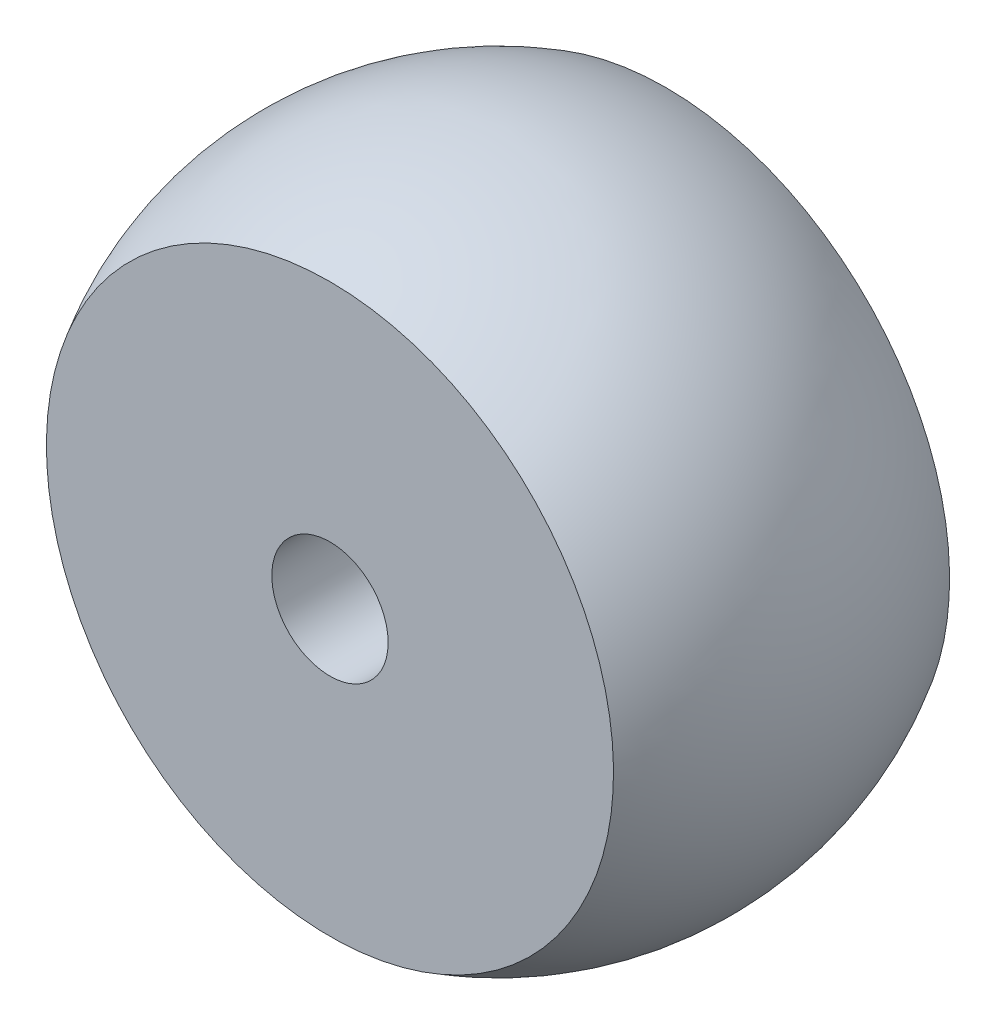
from build123d import *

# Parameters (mm, degrees)
SKIZZE1_R                       = 12.75
AUFSATZ_LINEAR_AUSTRAGEN1_DEPTH = 6.5
SKIZZE2_R                       = 2.25
SCHNITT_LINEAR_AUSTRAGEN1_DEPTH = 6.5


with BuildPart() as part:
    # Skizze1 → Aufsatz-Linear austragen1 (new, symmetric)
    with BuildSketch(Plane.XY):
        with Locations(Location((0, 0, 0), (0, 0, 180))):
            Circle(SKIZZE1_R)
    extrude(amount=AUFSATZ_LINEAR_AUSTRAGEN1_DEPTH, both=True)

    # Skizze2 → Schnitt-Linear austragen1 (cut, symmetric)
    with BuildSketch(Plane.XY):
        Circle(SKIZZE2_R)
    extrude(amount=SCHNITT_LINEAR_AUSTRAGEN1_DEPTH, both=True, mode=Mode.SUBTRACT)

    # Skizze3 → Schnitt-Rotation2 (revolve, cut)
    with BuildSketch(Plane(origin=(0, 0, 0), x_dir=(0, 0, -1), z_dir=(1, 0, 0))):
        with BuildLine():
            Line((-6.5, 10.968705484), (-6.5, 13.936393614))
            Line((-6.5, 13.936393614), (6.5, 13.936393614))
            Line((6.5, 13.936393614), (6.5, 10.968705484))
            ThreePointArc((6.5, 10.968705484), (0, 12.75), (-6.5, 10.968705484))
        make_face()
    revolve(axis=Axis((0, 0, 6.5), (0, 0, -1)), mode=Mode.SUBTRACT)


solid = part.part
